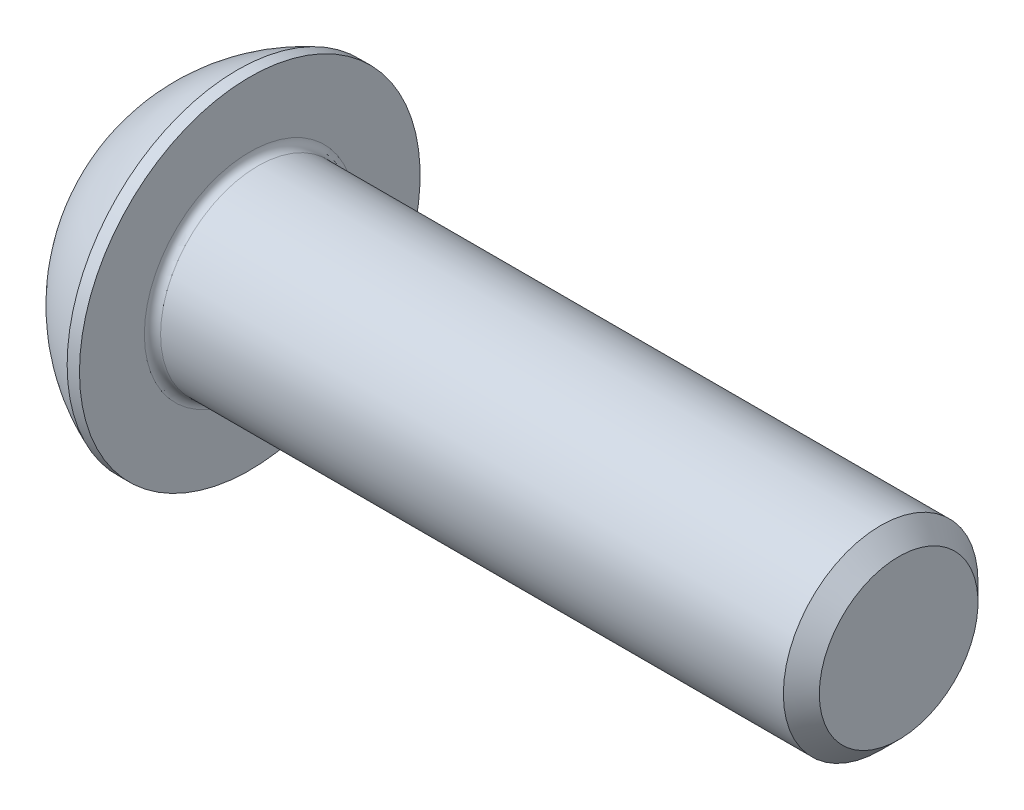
ISO-10303-21;
HEADER;
FILE_DESCRIPTION(('STEP AP214'),'2;1');
FILE_NAME('part.step','',(''),(''),'','','');
FILE_SCHEMA(('AUTOMOTIVE_DESIGN { 1 0 10303 214 1 1 1 1 }'));
ENDSEC;
DATA;
#1=APPLICATION_CONTEXT('core data for automotive mechanical design processes');
#2=APPLICATION_PROTOCOL_DEFINITION('international standard','automotive_design',2000,#1);
#3=PRODUCT_CONTEXT('',#1,'mechanical');
#4=PRODUCT('Part','Part','',(#3));
#5=PRODUCT_RELATED_PRODUCT_CATEGORY('part','',(#4));
#6=PRODUCT_DEFINITION_FORMATION('','',#4);
#7=PRODUCT_DEFINITION_CONTEXT('part definition',#1,'design');
#8=PRODUCT_DEFINITION('design','',#6,#7);
#9=PRODUCT_DEFINITION_SHAPE('','',#8);
#10=(LENGTH_UNIT() NAMED_UNIT(*) SI_UNIT(.MILLI.,.METRE.));
#11=(NAMED_UNIT(*) PLANE_ANGLE_UNIT() SI_UNIT($,.RADIAN.));
#12=(NAMED_UNIT(*) SI_UNIT($,.STERADIAN.) SOLID_ANGLE_UNIT());
#13=UNCERTAINTY_MEASURE_WITH_UNIT(LENGTH_MEASURE(1.E-05),#10,'distance_accuracy_value','');
#14=(GEOMETRIC_REPRESENTATION_CONTEXT(3) GLOBAL_UNCERTAINTY_ASSIGNED_CONTEXT((#13)) GLOBAL_UNIT_ASSIGNED_CONTEXT((#10,
#11,#12)) REPRESENTATION_CONTEXT('',''));
#15=CARTESIAN_POINT('',(0.,0.,0.));
#16=DIRECTION('',(0.,0.,1.));
#17=DIRECTION('',(1.,0.,0.));
#18=AXIS2_PLACEMENT_3D('',#15,#16,#17);
#19=CARTESIAN_POINT('',(0.,0.,0.));
#20=DIRECTION('',(-1.,0.,0.));
#21=DIRECTION('',(0.,0.,1.));
#22=AXIS2_PLACEMENT_3D('',#19,#20,#21);
#23=PLANE('',#22);
#24=CARTESIAN_POINT('',(0.,0.,0.));
#25=DIRECTION('',(-1.,0.,0.));
#26=DIRECTION('',(0.,0.,1.));
#27=AXIS2_PLACEMENT_3D('',#24,#25,#26);
#28=CIRCLE('',#27,2.625);
#29=CARTESIAN_POINT('',(0.,2.625,0.));
#30=VERTEX_POINT('',#29);
#31=EDGE_CURVE('E157',#30,#30,#28,.T.);
#32=ORIENTED_EDGE('',*,*,#31,.T.);
#33=EDGE_LOOP('',(#32));
#34=FACE_BOUND('',#33,.T.);
#35=DIRECTION('',(0.,-1.,0.));
#36=VECTOR('',#35,1.);
#37=CARTESIAN_POINT('',(0.,-1.15470053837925,2.));
#38=LINE('',#37,#36);
#39=CARTESIAN_POINT('',(0.,1.15470053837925,2.));
#40=VERTEX_POINT('',#39);
#41=CARTESIAN_POINT('',(0.,-1.15470053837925,2.));
#42=VERTEX_POINT('',#41);
#43=EDGE_CURVE('E52',#40,#42,#38,.T.);
#44=ORIENTED_EDGE('',*,*,#43,.T.);
#45=DIRECTION('',(0.,-0.5,-0.866025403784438));
#46=VECTOR('',#45,1.);
#47=CARTESIAN_POINT('',(0.,-2.3094010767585,0.));
#48=LINE('',#47,#46);
#49=CARTESIAN_POINT('',(0.,-2.3094010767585,0.));
#50=VERTEX_POINT('',#49);
#51=EDGE_CURVE('E277',#42,#50,#48,.T.);
#52=ORIENTED_EDGE('',*,*,#51,.T.);
#53=DIRECTION('',(0.,0.5,-0.866025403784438));
#54=VECTOR('',#53,1.);
#55=CARTESIAN_POINT('',(0.,-1.15470053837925,-2.));
#56=LINE('',#55,#54);
#57=CARTESIAN_POINT('',(0.,-1.15470053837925,-2.));
#58=VERTEX_POINT('',#57);
#59=EDGE_CURVE('E132',#50,#58,#56,.T.);
#60=ORIENTED_EDGE('',*,*,#59,.T.);
#61=DIRECTION('',(0.,1.,0.));
#62=VECTOR('',#61,1.);
#63=CARTESIAN_POINT('',(0.,1.15470053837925,-2.));
#64=LINE('',#63,#62);
#65=CARTESIAN_POINT('',(0.,1.15470053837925,-2.));
#66=VERTEX_POINT('',#65);
#67=EDGE_CURVE('E280',#58,#66,#64,.T.);
#68=ORIENTED_EDGE('',*,*,#67,.T.);
#69=DIRECTION('',(0.,0.5,0.866025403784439));
#70=VECTOR('',#69,1.);
#71=CARTESIAN_POINT('',(0.,2.3094010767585,0.));
#72=LINE('',#71,#70);
#73=CARTESIAN_POINT('',(0.,2.3094010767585,0.));
#74=VERTEX_POINT('',#73);
#75=EDGE_CURVE('E282',#66,#74,#72,.T.);
#76=ORIENTED_EDGE('',*,*,#75,.T.);
#77=DIRECTION('',(0.,-0.5,0.866025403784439));
#78=VECTOR('',#77,1.);
#79=CARTESIAN_POINT('',(0.,1.15470053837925,2.));
#80=LINE('',#79,#78);
#81=EDGE_CURVE('E284',#74,#40,#80,.T.);
#82=ORIENTED_EDGE('',*,*,#81,.T.);
#83=EDGE_LOOP('',(#44,#52,#60,#68,#76,#82));
#84=FACE_BOUND('',#83,.T.);
#85=ADVANCED_FACE('F37',(#34,#84),#23,.T.);
#86=CARTESIAN_POINT('',(4.99970462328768,0.,0.));
#87=DIRECTION('',(-1.,0.,0.));
#88=DIRECTION('',(0.,1.,0.));
#89=AXIS2_PLACEMENT_3D('',#86,#87,#88);
#90=SPHERICAL_SURFACE('',#89,5.64691697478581);
#91=CARTESIAN_POINT('',(2.92,0.,0.));
#92=DIRECTION('',(-1.,0.,0.));
#93=DIRECTION('',(0.,0.,1.));
#94=AXIS2_PLACEMENT_3D('',#91,#92,#93);
#95=CIRCLE('',#94,5.25);
#96=CARTESIAN_POINT('',(2.92,5.25,0.));
#97=VERTEX_POINT('',#96);
#98=EDGE_CURVE('E154',#97,#97,#95,.T.);
#99=CARTESIAN_POINT('',(2.92,5.25,0.));
#100=CARTESIAN_POINT('',(2.88116333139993,5.23461555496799,0.));
#101=CARTESIAN_POINT('',(2.84249743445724,5.21880002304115,0.));
#102=CARTESIAN_POINT('',(2.76552608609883,5.18631490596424,0.));
#103=CARTESIAN_POINT('',(2.72722063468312,5.16964532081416,0.));
#104=CARTESIAN_POINT('',(2.65098907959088,5.13546021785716,0.));
#105=CARTESIAN_POINT('',(2.61306297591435,5.11794470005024,0.));
#106=CARTESIAN_POINT('',(2.5376087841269,5.08207638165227,0.));
#107=CARTESIAN_POINT('',(2.50008069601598,5.06372358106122,0.));
#108=CARTESIAN_POINT('',(2.42544101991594,5.02618972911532,0.));
#109=CARTESIAN_POINT('',(2.38832943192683,5.00700867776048,0.));
#110=CARTESIAN_POINT('',(2.31454103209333,4.9678277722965,0.));
#111=CARTESIAN_POINT('',(2.27786422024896,4.94782791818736,0.));
#112=CARTESIAN_POINT('',(2.204963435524,4.90701925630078,0.));
#113=CARTESIAN_POINT('',(2.16873946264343,4.88621044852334,0.));
#114=CARTESIAN_POINT('',(2.09676219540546,4.84379412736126,0.));
#115=CARTESIAN_POINT('',(2.06100890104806,4.82218661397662,0.));
#116=CARTESIAN_POINT('',(1.9899905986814,4.77818352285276,0.));
#117=CARTESIAN_POINT('',(1.95472559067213,4.75578794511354,0.));
#118=CARTESIAN_POINT('',(1.88470122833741,4.7102197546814,0.));
#119=CARTESIAN_POINT('',(1.84994187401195,4.68704714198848,0.));
#120=CARTESIAN_POINT('',(1.78094593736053,4.63993629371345,0.));
#121=CARTESIAN_POINT('',(1.74670935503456,4.61599805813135,0.));
#122=CARTESIAN_POINT('',(1.67877582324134,4.56736775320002,0.));
#123=CARTESIAN_POINT('',(1.6450788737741,4.54267568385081,0.));
#124=CARTESIAN_POINT('',(1.57824120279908,4.4925498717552,0.));
#125=CARTESIAN_POINT('',(1.54510048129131,4.46711612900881,0.));
#126=CARTESIAN_POINT('',(1.4793915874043,4.4155194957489,0.));
#127=CARTESIAN_POINT('',(1.44682341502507,4.38935660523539,0.));
#128=CARTESIAN_POINT('',(1.3822756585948,4.33631456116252,0.));
#129=CARTESIAN_POINT('',(1.35029607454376,4.30943540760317,0.));
#130=CARTESIAN_POINT('',(1.28694124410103,4.2549740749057,0.));
#131=CARTESIAN_POINT('',(1.25556599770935,4.22739189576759,0.));
#132=CARTESIAN_POINT('',(1.19343529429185,4.17153809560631,0.));
#133=CARTESIAN_POINT('',(1.16267983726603,4.14326647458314,0.));
#134=CARTESIAN_POINT('',(1.10180385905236,4.0860477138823,0.));
#135=CARTESIAN_POINT('',(1.07168333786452,4.05710057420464,0.));
#136=CARTESIAN_POINT('',(1.01209206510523,3.99854503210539,0.));
#137=CARTESIAN_POINT('',(0.982621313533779,3.96893662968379,0.));
#138=CARTESIAN_POINT('',(0.924344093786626,3.90907314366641,0.));
#139=CARTESIAN_POINT('',(0.895537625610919,3.87881806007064,0.));
#140=CARTESIAN_POINT('',(0.838603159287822,3.8176761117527,0.));
#141=CARTESIAN_POINT('',(0.810475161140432,3.78678924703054,0.));
#142=CARTESIAN_POINT('',(0.754911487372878,3.72439894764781,0.));
#143=CARTESIAN_POINT('',(0.727475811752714,3.69289551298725,0.));
#144=CARTESIAN_POINT('',(0.673310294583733,3.62928758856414,0.));
#145=CARTESIAN_POINT('',(0.646580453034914,3.59718309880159,0.));
#146=CARTESIAN_POINT('',(0.593839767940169,3.53238887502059,0.));
#147=CARTESIAN_POINT('',(0.567828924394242,3.49969914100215,0.));
#148=CARTESIAN_POINT('',(0.516539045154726,3.43375052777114,0.));
#149=CARTESIAN_POINT('',(0.491260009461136,3.40049164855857,0.));
#150=CARTESIAN_POINT('',(0.441446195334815,3.33342112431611,0.));
#151=CARTESIAN_POINT('',(0.416911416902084,3.29960947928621,0.));
#152=CARTESIAN_POINT('',(0.368598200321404,3.23145007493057,0.));
#153=CARTESIAN_POINT('',(0.344819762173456,3.19710231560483,0.));
#154=CARTESIAN_POINT('',(0.298030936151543,3.12788759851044,0.));
#155=CARTESIAN_POINT('',(0.275020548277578,3.09302064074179,0.));
#156=CARTESIAN_POINT('',(0.229779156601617,3.02278469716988,0.));
#157=CARTESIAN_POINT('',(0.207548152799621,2.98741571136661,0.));
#158=CARTESIAN_POINT('',(0.163876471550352,2.91619313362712,0.));
#159=CARTESIAN_POINT('',(0.142435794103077,2.8803395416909,0.));
#160=CARTESIAN_POINT('',(0.100355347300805,2.80816539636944,0.));
#161=CARTESIAN_POINT('',(0.0797155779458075,2.7718448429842,0.));
#162=CARTESIAN_POINT('',(0.0392470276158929,2.69875470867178,0.));
#163=CARTESIAN_POINT('',(0.0194182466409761,2.66198512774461,0.));
#164=CARTESIAN_POINT('',(0.,2.625,0.));
#165=B_SPLINE_CURVE_WITH_KNOTS('',3,(#99,#100,#101,#102,#103,#104,#105,#106,#107,#108,#109,#110,
#111,#112,#113,#114,#115,#116,#117,#118,#119,#120,#121,#122,#123,#124,#125,#126,#127,#128,#129,
#130,#131,#132,#133,#134,#135,#136,#137,#138,#139,#140,#141,#142,#143,#144,#145,#146,#147,#148,
#149,#150,#151,#152,#153,#154,#155,#156,#157,#158,#159,#160,#161,#162,#163,#164),.UNSPECIFIED.,
.F.,.F.,(4,2,2,2,2,2,2,2,2,2,2,2,2,2,2,2,2,2,2,2,2,2,2,2,2,2,2,2,2,2,2,2,4),(0.,
0.12531586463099,0.25063172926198,0.37594759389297,0.50126345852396,0.62657932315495,
0.75189518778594,0.877211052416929,1.00252691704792,1.12784278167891,1.2531586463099,
1.37847451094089,1.50379037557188,1.62910624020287,1.75442210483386,1.87973796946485,
2.00505383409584,2.13036969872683,2.25568556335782,2.38100142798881,2.5063172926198,
2.63163315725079,2.75694902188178,2.88226488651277,3.00758075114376,3.13289661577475,
3.25821248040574,3.38352834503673,3.50884420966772,3.63416007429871,3.7594759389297,
3.88479180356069,4.01010766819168),.UNSPECIFIED.);
#166=EDGE_CURVE('BSEAM178',#97,#30,#165,.T.);
#167=ORIENTED_EDGE('',*,*,#98,.T.);
#168=ORIENTED_EDGE('',*,*,#31,.F.);
#169=ORIENTED_EDGE('',*,*,#166,.T.);
#170=ORIENTED_EDGE('',*,*,#166,.F.);
#171=EDGE_LOOP('',(#167,#169,#168,#170));
#172=FACE_BOUND('',#171,.T.);
#173=ADVANCED_FACE('F178',(#172),#90,.T.);
#174=CARTESIAN_POINT('',(0.,0.,0.));
#175=DIRECTION('',(-1.,0.,0.));
#176=DIRECTION('',(0.,0.,1.));
#177=AXIS2_PLACEMENT_3D('',#174,#175,#176);
#178=CYLINDRICAL_SURFACE('',#177,5.25);
#179=ORIENTED_EDGE('',*,*,#98,.F.);
#180=EDGE_LOOP('',(#179));
#181=FACE_BOUND('',#180,.T.);
#182=CARTESIAN_POINT('',(3.3,0.,0.));
#183=DIRECTION('',(-1.,0.,0.));
#184=DIRECTION('',(0.,0.,1.));
#185=AXIS2_PLACEMENT_3D('',#182,#183,#184);
#186=CIRCLE('',#185,5.25);
#187=CARTESIAN_POINT('',(3.3,0.,5.25));
#188=VERTEX_POINT('',#187);
#189=EDGE_CURVE('E151',#188,#188,#186,.T.);
#190=ORIENTED_EDGE('',*,*,#189,.T.);
#191=EDGE_LOOP('',(#190));
#192=FACE_BOUND('',#191,.T.);
#193=ADVANCED_FACE('F183',(#181,#192),#178,.T.);
#194=CARTESIAN_POINT('',(3.3,3.,0.));
#195=DIRECTION('',(-1.,0.,0.));
#196=DIRECTION('',(0.,0.,1.));
#197=AXIS2_PLACEMENT_3D('',#194,#195,#196);
#198=PLANE('',#197);
#199=CARTESIAN_POINT('',(3.3,0.,0.));
#200=DIRECTION('',(-1.,0.,0.));
#201=DIRECTION('',(0.,0.,1.));
#202=AXIS2_PLACEMENT_3D('',#199,#200,#201);
#203=CIRCLE('',#202,3.25);
#204=CARTESIAN_POINT('',(3.3,0.,3.25));
#205=VERTEX_POINT('',#204);
#206=EDGE_CURVE('E45',#205,#205,#203,.T.);
#207=ORIENTED_EDGE('',*,*,#206,.T.);
#208=EDGE_LOOP('',(#207));
#209=FACE_BOUND('',#208,.T.);
#210=ORIENTED_EDGE('',*,*,#189,.F.);
#211=EDGE_LOOP('',(#210));
#212=FACE_BOUND('',#211,.T.);
#213=ADVANCED_FACE('F162',(#209,#212),#198,.F.);
#214=CARTESIAN_POINT('',(0.,0.,0.));
#215=DIRECTION('',(-1.,0.,0.));
#216=DIRECTION('',(0.,0.,1.));
#217=AXIS2_PLACEMENT_3D('',#214,#215,#216);
#218=CYLINDRICAL_SURFACE('',#217,3.);
#219=CARTESIAN_POINT('',(3.55,0.,0.));
#220=DIRECTION('',(-1.,0.,0.));
#221=DIRECTION('',(0.,0.,1.));
#222=AXIS2_PLACEMENT_3D('',#219,#220,#221);
#223=CIRCLE('',#222,3.);
#224=CARTESIAN_POINT('',(3.55,0.,3.));
#225=VERTEX_POINT('',#224);
#226=EDGE_CURVE('E11',#225,#225,#223,.F.);
#227=ORIENTED_EDGE('',*,*,#226,.T.);
#228=EDGE_LOOP('',(#227));
#229=FACE_BOUND('',#228,.T.);
#230=CARTESIAN_POINT('',(22.7455,0.,0.));
#231=DIRECTION('',(-1.,0.,0.));
#232=DIRECTION('',(0.,0.,1.));
#233=AXIS2_PLACEMENT_3D('',#230,#231,#232);
#234=CIRCLE('',#233,3.);
#235=CARTESIAN_POINT('',(22.7455,0.,3.));
#236=VERTEX_POINT('',#235);
#237=EDGE_CURVE('E148',#236,#236,#234,.T.);
#238=ORIENTED_EDGE('',*,*,#237,.T.);
#239=EDGE_LOOP('',(#238));
#240=FACE_BOUND('',#239,.T.);
#241=ADVANCED_FACE('F192',(#229,#240),#218,.T.);
#242=CARTESIAN_POINT('',(23.3,0.,0.));
#243=DIRECTION('',(-1.,0.,0.));
#244=DIRECTION('',(0.,0.,1.));
#245=AXIS2_PLACEMENT_3D('',#242,#243,#244);
#246=CONICAL_SURFACE('',#245,2.4455,0.785398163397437);
#247=ORIENTED_EDGE('',*,*,#237,.F.);
#248=EDGE_LOOP('',(#247));
#249=FACE_BOUND('',#248,.T.);
#250=CARTESIAN_POINT('',(23.3,0.,0.));
#251=DIRECTION('',(-1.,0.,0.));
#252=DIRECTION('',(0.,0.,1.));
#253=AXIS2_PLACEMENT_3D('',#250,#251,#252);
#254=CIRCLE('',#253,2.4455);
#255=CARTESIAN_POINT('',(23.3,0.,2.4455));
#256=VERTEX_POINT('',#255);
#257=EDGE_CURVE('E144',#256,#256,#254,.T.);
#258=ORIENTED_EDGE('',*,*,#257,.T.);
#259=EDGE_LOOP('',(#258));
#260=FACE_BOUND('',#259,.T.);
#261=ADVANCED_FACE('F173',(#249,#260),#246,.T.);
#262=CARTESIAN_POINT('',(23.3,0.,0.));
#263=DIRECTION('',(-1.,0.,0.));
#264=DIRECTION('',(0.,0.,1.));
#265=AXIS2_PLACEMENT_3D('',#262,#263,#264);
#266=PLANE('',#265);
#267=ORIENTED_EDGE('',*,*,#257,.F.);
#268=EDGE_LOOP('',(#267));
#269=FACE_BOUND('',#268,.T.);
#270=ADVANCED_FACE('F166',(#269),#266,.F.);
#271=CARTESIAN_POINT('',(3.55,0.,0.));
#272=DIRECTION('',(-1.,0.,0.));
#273=DIRECTION('',(0.,0.,1.));
#274=AXIS2_PLACEMENT_3D('',#271,#272,#273);
#275=TOROIDAL_SURFACE('',#274,3.25,0.25);
#276=ORIENTED_EDGE('',*,*,#226,.F.);
#277=EDGE_LOOP('',(#276));
#278=FACE_BOUND('',#277,.T.);
#279=ORIENTED_EDGE('',*,*,#206,.F.);
#280=EDGE_LOOP('',(#279));
#281=FACE_BOUND('',#280,.T.);
#282=ADVANCED_FACE('F39',(#278,#281),#275,.F.);
#283=CARTESIAN_POINT('',(2.08,-2.3094010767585,0.));
#284=DIRECTION('',(0.,0.866025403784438,-0.500000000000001));
#285=DIRECTION('',(0.,0.500000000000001,0.866025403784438));
#286=AXIS2_PLACEMENT_3D('',#283,#284,#285);
#287=PLANE('',#286);
#288=DIRECTION('',(0.,-0.5,-0.866025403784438));
#289=VECTOR('',#288,1.);
#290=CARTESIAN_POINT('',(2.08,-2.3094010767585,0.));
#291=LINE('',#290,#289);
#292=CARTESIAN_POINT('',(2.08,-1.15470053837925,2.));
#293=VERTEX_POINT('',#292);
#294=CARTESIAN_POINT('',(2.08,-1.73205080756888,1.));
#295=VERTEX_POINT('',#294);
#296=EDGE_CURVE('E118',#293,#295,#291,.T.);
#297=ORIENTED_EDGE('',*,*,#296,.T.);
#298=CARTESIAN_POINT('',(2.08,-2.3094010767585,0.));
#299=VERTEX_POINT('',#298);
#300=EDGE_CURVE('E113',#295,#299,#291,.T.);
#301=ORIENTED_EDGE('',*,*,#300,.T.);
#302=DIRECTION('',(-1.,0.,0.));
#303=VECTOR('',#302,1.);
#304=CARTESIAN_POINT('',(2.08,-2.3094010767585,0.));
#305=LINE('',#304,#303);
#306=EDGE_CURVE('E115',#299,#50,#305,.T.);
#307=ORIENTED_EDGE('',*,*,#306,.T.);
#308=ORIENTED_EDGE('',*,*,#51,.F.);
#309=DIRECTION('',(-1.,0.,0.));
#310=VECTOR('',#309,1.);
#311=CARTESIAN_POINT('',(2.08,-1.15470053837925,2.));
#312=LINE('',#311,#310);
#313=EDGE_CURVE('E273',#293,#42,#312,.T.);
#314=ORIENTED_EDGE('',*,*,#313,.F.);
#315=EDGE_LOOP('',(#297,#301,#307,#308,#314));
#316=FACE_BOUND('',#315,.T.);
#317=ADVANCED_FACE('F114',(#316),#287,.T.);
#318=CARTESIAN_POINT('',(2.08,-1.15470053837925,-2.));
#319=DIRECTION('',(0.,0.866025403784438,0.5));
#320=DIRECTION('',(0.,-0.5,0.866025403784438));
#321=AXIS2_PLACEMENT_3D('',#318,#319,#320);
#322=PLANE('',#321);
#323=DIRECTION('',(0.,0.5,-0.866025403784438));
#324=VECTOR('',#323,1.);
#325=CARTESIAN_POINT('',(2.08,-1.15470053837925,-2.));
#326=LINE('',#325,#324);
#327=CARTESIAN_POINT('',(2.08,-1.73205080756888,-1.));
#328=VERTEX_POINT('',#327);
#329=EDGE_CURVE('E60',#299,#328,#326,.T.);
#330=ORIENTED_EDGE('',*,*,#329,.T.);
#331=CARTESIAN_POINT('',(2.08,-1.15470053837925,-2.));
#332=VERTEX_POINT('',#331);
#333=EDGE_CURVE('E127',#328,#332,#326,.T.);
#334=ORIENTED_EDGE('',*,*,#333,.T.);
#335=DIRECTION('',(-1.,0.,0.));
#336=VECTOR('',#335,1.);
#337=CARTESIAN_POINT('',(2.08,-1.15470053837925,-2.));
#338=LINE('',#337,#336);
#339=EDGE_CURVE('E134',#332,#58,#338,.T.);
#340=ORIENTED_EDGE('',*,*,#339,.T.);
#341=ORIENTED_EDGE('',*,*,#59,.F.);
#342=ORIENTED_EDGE('',*,*,#306,.F.);
#343=EDGE_LOOP('',(#330,#334,#340,#341,#342));
#344=FACE_BOUND('',#343,.T.);
#345=ADVANCED_FACE('F130',(#344),#322,.T.);
#346=CARTESIAN_POINT('',(2.08,1.15470053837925,-2.));
#347=DIRECTION('',(0.,0.,1.));
#348=DIRECTION('',(1.,0.,0.));
#349=AXIS2_PLACEMENT_3D('',#346,#347,#348);
#350=PLANE('',#349);
#351=DIRECTION('',(0.,1.,0.));
#352=VECTOR('',#351,1.);
#353=CARTESIAN_POINT('',(2.08,1.15470053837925,-2.));
#354=LINE('',#353,#352);
#355=CARTESIAN_POINT('',(2.08,0.,-2.));
#356=VERTEX_POINT('',#355);
#357=EDGE_CURVE('E254',#332,#356,#354,.T.);
#358=ORIENTED_EDGE('',*,*,#357,.T.);
#359=CARTESIAN_POINT('',(2.08,1.15470053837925,-2.));
#360=VERTEX_POINT('',#359);
#361=EDGE_CURVE('E126',#356,#360,#354,.T.);
#362=ORIENTED_EDGE('',*,*,#361,.T.);
#363=DIRECTION('',(-1.,0.,0.));
#364=VECTOR('',#363,1.);
#365=CARTESIAN_POINT('',(2.08,1.15470053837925,-2.));
#366=LINE('',#365,#364);
#367=EDGE_CURVE('E139',#360,#66,#366,.T.);
#368=ORIENTED_EDGE('',*,*,#367,.T.);
#369=ORIENTED_EDGE('',*,*,#67,.F.);
#370=ORIENTED_EDGE('',*,*,#339,.F.);
#371=EDGE_LOOP('',(#358,#362,#368,#369,#370));
#372=FACE_BOUND('',#371,.T.);
#373=ADVANCED_FACE('F206',(#372),#350,.T.);
#374=CARTESIAN_POINT('',(2.08,2.3094010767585,0.));
#375=DIRECTION('',(0.,-0.866025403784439,0.5));
#376=DIRECTION('',(0.,-0.5,-0.866025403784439));
#377=AXIS2_PLACEMENT_3D('',#374,#375,#376);
#378=PLANE('',#377);
#379=DIRECTION('',(0.,0.5,0.866025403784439));
#380=VECTOR('',#379,1.);
#381=CARTESIAN_POINT('',(2.08,2.3094010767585,0.));
#382=LINE('',#381,#380);
#383=CARTESIAN_POINT('',(2.08,1.73205080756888,-0.999999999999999));
#384=VERTEX_POINT('',#383);
#385=EDGE_CURVE('E243',#360,#384,#382,.T.);
#386=ORIENTED_EDGE('',*,*,#385,.T.);
#387=CARTESIAN_POINT('',(2.08,2.3094010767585,0.));
#388=VERTEX_POINT('',#387);
#389=EDGE_CURVE('E248',#384,#388,#382,.T.);
#390=ORIENTED_EDGE('',*,*,#389,.T.);
#391=DIRECTION('',(-1.,0.,0.));
#392=VECTOR('',#391,1.);
#393=CARTESIAN_POINT('',(2.08,2.3094010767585,0.));
#394=LINE('',#393,#392);
#395=EDGE_CURVE('E288',#388,#74,#394,.T.);
#396=ORIENTED_EDGE('',*,*,#395,.T.);
#397=ORIENTED_EDGE('',*,*,#75,.F.);
#398=ORIENTED_EDGE('',*,*,#367,.F.);
#399=EDGE_LOOP('',(#386,#390,#396,#397,#398));
#400=FACE_BOUND('',#399,.T.);
#401=ADVANCED_FACE('F209',(#400),#378,.T.);
#402=CARTESIAN_POINT('',(2.08,1.15470053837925,2.));
#403=DIRECTION('',(0.,-0.866025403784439,-0.5));
#404=DIRECTION('',(0.,0.5,-0.866025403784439));
#405=AXIS2_PLACEMENT_3D('',#402,#403,#404);
#406=PLANE('',#405);
#407=DIRECTION('',(0.,-0.5,0.866025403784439));
#408=VECTOR('',#407,1.);
#409=CARTESIAN_POINT('',(2.08,1.15470053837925,2.));
#410=LINE('',#409,#408);
#411=CARTESIAN_POINT('',(2.08,1.73205080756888,0.999999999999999));
#412=VERTEX_POINT('',#411);
#413=EDGE_CURVE('E251',#388,#412,#410,.T.);
#414=ORIENTED_EDGE('',*,*,#413,.T.);
#415=CARTESIAN_POINT('',(2.08,1.15470053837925,2.));
#416=VERTEX_POINT('',#415);
#417=EDGE_CURVE('E259',#412,#416,#410,.T.);
#418=ORIENTED_EDGE('',*,*,#417,.T.);
#419=DIRECTION('',(-1.,0.,0.));
#420=VECTOR('',#419,1.);
#421=CARTESIAN_POINT('',(2.08,1.15470053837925,2.));
#422=LINE('',#421,#420);
#423=EDGE_CURVE('E272',#416,#40,#422,.T.);
#424=ORIENTED_EDGE('',*,*,#423,.T.);
#425=ORIENTED_EDGE('',*,*,#81,.F.);
#426=ORIENTED_EDGE('',*,*,#395,.F.);
#427=EDGE_LOOP('',(#414,#418,#424,#425,#426));
#428=FACE_BOUND('',#427,.T.);
#429=ADVANCED_FACE('F213',(#428),#406,.T.);
#430=CARTESIAN_POINT('',(2.08,-1.15470053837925,2.));
#431=DIRECTION('',(0.,0.,-1.));
#432=DIRECTION('',(-1.,0.,0.));
#433=AXIS2_PLACEMENT_3D('',#430,#431,#432);
#434=PLANE('',#433);
#435=DIRECTION('',(0.,-1.,0.));
#436=VECTOR('',#435,1.);
#437=CARTESIAN_POINT('',(2.08,-1.15470053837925,2.));
#438=LINE('',#437,#436);
#439=CARTESIAN_POINT('',(2.08,0.,2.));
#440=VERTEX_POINT('',#439);
#441=EDGE_CURVE('E265',#416,#440,#438,.T.);
#442=ORIENTED_EDGE('',*,*,#441,.T.);
#443=EDGE_CURVE('E267',#440,#293,#438,.T.);
#444=ORIENTED_EDGE('',*,*,#443,.T.);
#445=ORIENTED_EDGE('',*,*,#313,.T.);
#446=ORIENTED_EDGE('',*,*,#43,.F.);
#447=ORIENTED_EDGE('',*,*,#423,.F.);
#448=EDGE_LOOP('',(#442,#444,#445,#446,#447));
#449=FACE_BOUND('',#448,.T.);
#450=ADVANCED_FACE('F217',(#449),#434,.T.);
#451=CARTESIAN_POINT('',(2.08,-2.3094010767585,0.));
#452=DIRECTION('',(1.,0.,0.));
#453=DIRECTION('',(0.,0.,-1.));
#454=AXIS2_PLACEMENT_3D('',#451,#452,#453);
#455=PLANE('',#454);
#456=CARTESIAN_POINT('',(2.08,0.,0.));
#457=DIRECTION('',(-1.,0.,0.));
#458=DIRECTION('',(0.,0.,1.));
#459=AXIS2_PLACEMENT_3D('',#456,#457,#458);
#460=CIRCLE('',#459,2.);
#461=EDGE_CURVE('E240',#384,#356,#460,.T.);
#462=ORIENTED_EDGE('',*,*,#461,.F.);
#463=ORIENTED_EDGE('',*,*,#385,.F.);
#464=ORIENTED_EDGE('',*,*,#361,.F.);
#465=EDGE_LOOP('',(#462,#463,#464));
#466=FACE_BOUND('',#465,.T.);
#467=ADVANCED_FACE('F221',(#466),#455,.F.);
#468=EDGE_CURVE('E145',#412,#384,#460,.T.);
#469=ORIENTED_EDGE('',*,*,#468,.F.);
#470=ORIENTED_EDGE('',*,*,#413,.F.);
#471=ORIENTED_EDGE('',*,*,#389,.F.);
#472=EDGE_LOOP('',(#469,#470,#471));
#473=FACE_BOUND('',#472,.T.);
#474=ADVANCED_FACE('F230',(#473),#455,.F.);
#475=EDGE_CURVE('E138',#440,#412,#460,.T.);
#476=ORIENTED_EDGE('',*,*,#475,.F.);
#477=ORIENTED_EDGE('',*,*,#441,.F.);
#478=ORIENTED_EDGE('',*,*,#417,.F.);
#479=EDGE_LOOP('',(#476,#477,#478));
#480=FACE_BOUND('',#479,.T.);
#481=ADVANCED_FACE('F235',(#480),#455,.F.);
#482=EDGE_CURVE('E133',#295,#440,#460,.T.);
#483=ORIENTED_EDGE('',*,*,#482,.F.);
#484=ORIENTED_EDGE('',*,*,#296,.F.);
#485=ORIENTED_EDGE('',*,*,#443,.F.);
#486=EDGE_LOOP('',(#483,#484,#485));
#487=FACE_BOUND('',#486,.T.);
#488=ADVANCED_FACE('F228',(#487),#455,.F.);
#489=EDGE_CURVE('E124',#328,#295,#460,.T.);
#490=ORIENTED_EDGE('',*,*,#489,.F.);
#491=ORIENTED_EDGE('',*,*,#329,.F.);
#492=ORIENTED_EDGE('',*,*,#300,.F.);
#493=EDGE_LOOP('',(#490,#491,#492));
#494=FACE_BOUND('',#493,.T.);
#495=ADVANCED_FACE('F123',(#494),#455,.F.);
#496=EDGE_CURVE('E246',#356,#328,#460,.T.);
#497=ORIENTED_EDGE('',*,*,#496,.F.);
#498=ORIENTED_EDGE('',*,*,#357,.F.);
#499=ORIENTED_EDGE('',*,*,#333,.F.);
#500=EDGE_LOOP('',(#497,#498,#499));
#501=FACE_BOUND('',#500,.T.);
#502=ADVANCED_FACE('F201',(#501),#455,.F.);
#503=CARTESIAN_POINT('',(3.23470053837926,0.,0.));
#504=DIRECTION('',(-1.,0.,0.));
#505=DIRECTION('',(0.,0.,1.));
#506=AXIS2_PLACEMENT_3D('',#503,#504,#505);
#507=CONICAL_SURFACE('',#506,0.,1.04719755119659);
#508=ORIENTED_EDGE('',*,*,#475,.T.);
#509=ORIENTED_EDGE('',*,*,#468,.T.);
#510=ORIENTED_EDGE('',*,*,#461,.T.);
#511=ORIENTED_EDGE('',*,*,#496,.T.);
#512=ORIENTED_EDGE('',*,*,#489,.T.);
#513=ORIENTED_EDGE('',*,*,#482,.T.);
#514=EDGE_LOOP('',(#508,#509,#510,#511,#512,#513));
#515=FACE_BOUND('',#514,.T.);
#516=CARTESIAN_POINT('',(3.23470053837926,0.,0.));
#517=VERTEX_POINT('',#516);
#518=VERTEX_LOOP('',#517);
#519=FACE_BOUND('',#518,.T.);
#520=ADVANCED_FACE('F199',(#515,#519),#507,.F.);
#521=CLOSED_SHELL('',(#85,#173,#193,#213,#241,#261,#270,#282,#317,#345,#373,#401,#429,#450,#467,
#474,#481,#488,#495,#502,#520));
#522=MANIFOLD_SOLID_BREP('B2',#521);
#523=ADVANCED_BREP_SHAPE_REPRESENTATION('',(#18,#522),#14);
#524=SHAPE_DEFINITION_REPRESENTATION(#9,#523);
ENDSEC;
END-ISO-10303-21;
